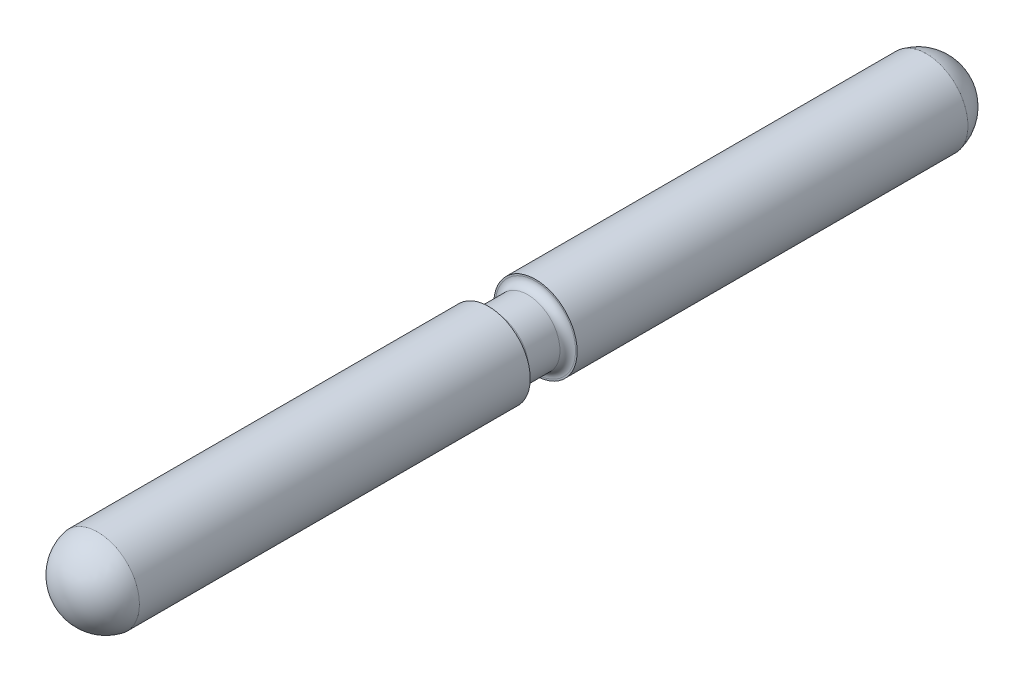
ISO-10303-21;
HEADER;
FILE_DESCRIPTION(('STEP AP214'),'2;1');
FILE_NAME('part.step','',(''),(''),'','','');
FILE_SCHEMA(('AUTOMOTIVE_DESIGN { 1 0 10303 214 1 1 1 1 }'));
ENDSEC;
DATA;
#1=APPLICATION_CONTEXT('core data for automotive mechanical design processes');
#2=APPLICATION_PROTOCOL_DEFINITION('international standard','automotive_design',2000,#1);
#3=PRODUCT_CONTEXT('',#1,'mechanical');
#4=PRODUCT('Part','Part','',(#3));
#5=PRODUCT_RELATED_PRODUCT_CATEGORY('part','',(#4));
#6=PRODUCT_DEFINITION_FORMATION('','',#4);
#7=PRODUCT_DEFINITION_CONTEXT('part definition',#1,'design');
#8=PRODUCT_DEFINITION('design','',#6,#7);
#9=PRODUCT_DEFINITION_SHAPE('','',#8);
#10=(LENGTH_UNIT() NAMED_UNIT(*) SI_UNIT(.MILLI.,.METRE.));
#11=(NAMED_UNIT(*) PLANE_ANGLE_UNIT() SI_UNIT($,.RADIAN.));
#12=(NAMED_UNIT(*) SI_UNIT($,.STERADIAN.) SOLID_ANGLE_UNIT());
#13=UNCERTAINTY_MEASURE_WITH_UNIT(LENGTH_MEASURE(1.E-05),#10,'distance_accuracy_value','');
#14=(GEOMETRIC_REPRESENTATION_CONTEXT(3) GLOBAL_UNCERTAINTY_ASSIGNED_CONTEXT((#13)) GLOBAL_UNIT_ASSIGNED_CONTEXT((#10,
#11,#12)) REPRESENTATION_CONTEXT('',''));
#15=CARTESIAN_POINT('',(0.,0.,0.));
#16=DIRECTION('',(0.,0.,1.));
#17=DIRECTION('',(1.,0.,0.));
#18=AXIS2_PLACEMENT_3D('',#15,#16,#17);
#19=CARTESIAN_POINT('',(0.145114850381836,0.,83.9831680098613));
#20=DIRECTION('',(0.,-1.,0.));
#21=DIRECTION('',(1.,0.,0.));
#22=AXIS2_PLACEMENT_3D('',#19,#20,#21);
#23=CIRCLE('',#22,8.);
#24=TRIMMED_CURVE('',#23,(PARAMETER_VALUE(-1.5889366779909)),(PARAMETER_VALUE(1.5889366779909)),
.T.,.PARAMETER.);
#25=CARTESIAN_POINT('',(0.,0.,83.9831680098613));
#26=DIRECTION('',(0.,0.,1.));
#27=AXIS1_PLACEMENT('',#25,#26);
#28=SURFACE_OF_REVOLUTION('',#24,#27);
#29=CARTESIAN_POINT('',(0.,0.,91.9818517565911));
#30=VERTEX_POINT('',#29);
#31=VERTEX_LOOP('',#30);
#32=FACE_BOUND('',#31,.T.);
#33=CARTESIAN_POINT('',(0.,0.,85.5));
#34=DIRECTION('',(0.,0.,1.));
#35=DIRECTION('',(1.,0.,0.));
#36=AXIS2_PLACEMENT_3D('',#33,#34,#35);
#37=CIRCLE('',#36,8.);
#38=CARTESIAN_POINT('',(8.,0.,85.5));
#39=VERTEX_POINT('',#38);
#40=EDGE_CURVE('E48',#39,#39,#37,.T.);
#41=ORIENTED_EDGE('',*,*,#40,.T.);
#42=EDGE_LOOP('',(#41));
#43=FACE_BOUND('',#42,.T.);
#44=ADVANCED_FACE('F30',(#32,#43),#28,.T.);
#45=CARTESIAN_POINT('',(0.,0.,100.));
#46=DIRECTION('',(0.,0.,1.));
#47=DIRECTION('',(1.,0.,0.));
#48=AXIS2_PLACEMENT_3D('',#45,#46,#47);
#49=CYLINDRICAL_SURFACE('',#48,8.);
#50=ORIENTED_EDGE('',*,*,#40,.F.);
#51=EDGE_LOOP('',(#50));
#52=FACE_BOUND('',#51,.T.);
#53=CARTESIAN_POINT('',(0.,0.,10.5));
#54=DIRECTION('',(0.,0.,1.));
#55=DIRECTION('',(1.,0.,0.));
#56=AXIS2_PLACEMENT_3D('',#53,#54,#55);
#57=CIRCLE('',#56,8.);
#58=CARTESIAN_POINT('',(8.,0.,10.5));
#59=VERTEX_POINT('',#58);
#60=EDGE_CURVE('E51',#59,#59,#57,.T.);
#61=ORIENTED_EDGE('',*,*,#60,.T.);
#62=EDGE_LOOP('',(#61));
#63=FACE_BOUND('',#62,.T.);
#64=ADVANCED_FACE('F45',(#52,#63),#49,.T.);
#65=CARTESIAN_POINT('',(0.,8.,10.5));
#66=DIRECTION('',(0.,0.,1.));
#67=DIRECTION('',(1.,0.,0.));
#68=AXIS2_PLACEMENT_3D('',#65,#66,#67);
#69=PLANE('',#68);
#70=CARTESIAN_POINT('',(0.,0.,10.5));
#71=DIRECTION('',(0.,0.,1.));
#72=DIRECTION('',(1.,0.,0.));
#73=AXIS2_PLACEMENT_3D('',#70,#71,#72);
#74=CIRCLE('',#73,7.69999999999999);
#75=CARTESIAN_POINT('',(7.69999999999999,0.,10.5));
#76=VERTEX_POINT('',#75);
#77=EDGE_CURVE('E11',#76,#76,#74,.T.);
#78=ORIENTED_EDGE('',*,*,#77,.T.);
#79=EDGE_LOOP('',(#78));
#80=FACE_BOUND('',#79,.T.);
#81=ORIENTED_EDGE('',*,*,#60,.F.);
#82=EDGE_LOOP('',(#81));
#83=FACE_BOUND('',#82,.T.);
#84=ADVANCED_FACE('F79',(#80,#83),#69,.F.);
#85=CARTESIAN_POINT('',(0.,0.,100.));
#86=DIRECTION('',(0.,0.,1.));
#87=DIRECTION('',(1.,0.,0.));
#88=AXIS2_PLACEMENT_3D('',#85,#86,#87);
#89=CYLINDRICAL_SURFACE('',#88,6.19999999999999);
#90=CARTESIAN_POINT('',(0.,0.,3.));
#91=DIRECTION('',(0.,0.,-1.));
#92=DIRECTION('',(-1.,0.,0.));
#93=AXIS2_PLACEMENT_3D('',#90,#91,#92);
#94=CIRCLE('',#93,6.19999999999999);
#95=CARTESIAN_POINT('',(-6.19999999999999,0.,3.));
#96=VERTEX_POINT('',#95);
#97=EDGE_CURVE('E54',#96,#96,#94,.F.);
#98=ORIENTED_EDGE('',*,*,#97,.T.);
#99=EDGE_LOOP('',(#98));
#100=FACE_BOUND('',#99,.T.);
#101=CARTESIAN_POINT('',(0.,0.,9.00000000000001));
#102=DIRECTION('',(0.,0.,1.));
#103=DIRECTION('',(1.,0.,0.));
#104=AXIS2_PLACEMENT_3D('',#101,#102,#103);
#105=CIRCLE('',#104,6.19999999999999);
#106=CARTESIAN_POINT('',(6.19999999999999,0.,9.00000000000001));
#107=VERTEX_POINT('',#106);
#108=EDGE_CURVE('E50',#107,#107,#105,.F.);
#109=ORIENTED_EDGE('',*,*,#108,.T.);
#110=EDGE_LOOP('',(#109));
#111=FACE_BOUND('',#110,.T.);
#112=ADVANCED_FACE('F76',(#100,#111),#89,.T.);
#113=CARTESIAN_POINT('',(0.,8.,1.5));
#114=DIRECTION('',(0.,0.,-1.));
#115=DIRECTION('',(-1.,0.,0.));
#116=AXIS2_PLACEMENT_3D('',#113,#114,#115);
#117=PLANE('',#116);
#118=CARTESIAN_POINT('',(0.,0.,1.5));
#119=DIRECTION('',(0.,0.,-1.));
#120=DIRECTION('',(-1.,0.,0.));
#121=AXIS2_PLACEMENT_3D('',#118,#119,#120);
#122=CIRCLE('',#121,7.69999999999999);
#123=CARTESIAN_POINT('',(-7.69999999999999,0.,1.5));
#124=VERTEX_POINT('',#123);
#125=EDGE_CURVE('E37',#124,#124,#122,.T.);
#126=ORIENTED_EDGE('',*,*,#125,.T.);
#127=EDGE_LOOP('',(#126));
#128=FACE_BOUND('',#127,.T.);
#129=CARTESIAN_POINT('',(0.,0.,1.5));
#130=DIRECTION('',(0.,0.,1.));
#131=DIRECTION('',(1.,0.,0.));
#132=AXIS2_PLACEMENT_3D('',#129,#130,#131);
#133=CIRCLE('',#132,8.);
#134=CARTESIAN_POINT('',(8.,0.,1.5));
#135=VERTEX_POINT('',#134);
#136=EDGE_CURVE('E57',#135,#135,#133,.T.);
#137=ORIENTED_EDGE('',*,*,#136,.T.);
#138=EDGE_LOOP('',(#137));
#139=FACE_BOUND('',#138,.T.);
#140=ADVANCED_FACE('F65',(#128,#139),#117,.F.);
#141=CARTESIAN_POINT('',(0.,0.,100.));
#142=DIRECTION('',(0.,0.,1.));
#143=DIRECTION('',(1.,0.,0.));
#144=AXIS2_PLACEMENT_3D('',#141,#142,#143);
#145=CYLINDRICAL_SURFACE('',#144,8.);
#146=ORIENTED_EDGE('',*,*,#136,.F.);
#147=EDGE_LOOP('',(#146));
#148=FACE_BOUND('',#147,.T.);
#149=CARTESIAN_POINT('',(0.,0.,-73.5));
#150=DIRECTION('',(0.,0.,1.));
#151=DIRECTION('',(1.,0.,0.));
#152=AXIS2_PLACEMENT_3D('',#149,#150,#151);
#153=CIRCLE('',#152,8.);
#154=CARTESIAN_POINT('',(8.,0.,-73.5));
#155=VERTEX_POINT('',#154);
#156=EDGE_CURVE('E109',#155,#155,#153,.T.);
#157=ORIENTED_EDGE('',*,*,#156,.T.);
#158=EDGE_LOOP('',(#157));
#159=FACE_BOUND('',#158,.T.);
#160=ADVANCED_FACE('F99',(#148,#159),#145,.T.);
#161=CARTESIAN_POINT('',(0.145114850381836,0.,-71.9831680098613));
#162=DIRECTION('',(0.,-1.,0.));
#163=DIRECTION('',(1.,0.,0.));
#164=AXIS2_PLACEMENT_3D('',#161,#162,#163);
#165=CIRCLE('',#164,8.);
#166=TRIMMED_CURVE('',#165,(PARAMETER_VALUE(-1.5889366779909)),
(PARAMETER_VALUE(1.5889366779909)),.T.,.PARAMETER.);
#167=CARTESIAN_POINT('',(0.,0.,-71.9831680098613));
#168=DIRECTION('',(0.,0.,1.));
#169=AXIS1_PLACEMENT('',#167,#168);
#170=SURFACE_OF_REVOLUTION('',#166,#169);
#171=ORIENTED_EDGE('',*,*,#156,.F.);
#172=EDGE_LOOP('',(#171));
#173=FACE_BOUND('',#172,.T.);
#174=CARTESIAN_POINT('',(0.,0.,-79.9818517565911));
#175=VERTEX_POINT('',#174);
#176=VERTEX_LOOP('',#175);
#177=FACE_BOUND('',#176,.T.);
#178=ADVANCED_FACE('F72',(#173,#177),#170,.T.);
#179=CARTESIAN_POINT('',(0.,0.,3.));
#180=DIRECTION('',(0.,0.,-1.));
#181=DIRECTION('',(-1.,0.,0.));
#182=AXIS2_PLACEMENT_3D('',#179,#180,#181);
#183=TOROIDAL_SURFACE('',#182,7.69999999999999,1.5);
#184=ORIENTED_EDGE('',*,*,#125,.F.);
#185=EDGE_LOOP('',(#184));
#186=FACE_BOUND('',#185,.T.);
#187=ORIENTED_EDGE('',*,*,#97,.F.);
#188=EDGE_LOOP('',(#187));
#189=FACE_BOUND('',#188,.T.);
#190=ADVANCED_FACE('F68',(#186,#189),#183,.F.);
#191=CARTESIAN_POINT('',(0.,0.,9.00000000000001));
#192=DIRECTION('',(0.,0.,1.));
#193=DIRECTION('',(1.,0.,0.));
#194=AXIS2_PLACEMENT_3D('',#191,#192,#193);
#195=TOROIDAL_SURFACE('',#194,7.69999999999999,1.5);
#196=ORIENTED_EDGE('',*,*,#108,.F.);
#197=EDGE_LOOP('',(#196));
#198=FACE_BOUND('',#197,.T.);
#199=ORIENTED_EDGE('',*,*,#77,.F.);
#200=EDGE_LOOP('',(#199));
#201=FACE_BOUND('',#200,.T.);
#202=ADVANCED_FACE('F71',(#198,#201),#195,.F.);
#203=CLOSED_SHELL('',(#44,#64,#84,#112,#140,#160,#178,#190,#202));
#204=MANIFOLD_SOLID_BREP('B2',#203);
#205=ADVANCED_BREP_SHAPE_REPRESENTATION('',(#18,#204),#14);
#206=SHAPE_DEFINITION_REPRESENTATION(#9,#205);
ENDSEC;
END-ISO-10303-21;
